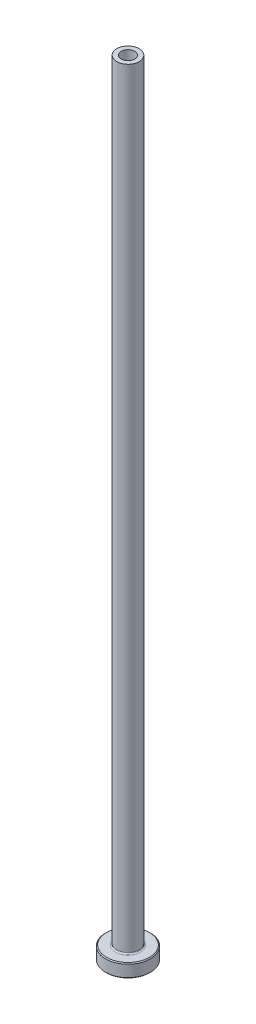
ISO-10303-21;
HEADER;
FILE_DESCRIPTION(('STEP AP214'),'2;1');
FILE_NAME('part.step','',(''),(''),'','','');
FILE_SCHEMA(('AUTOMOTIVE_DESIGN { 1 0 10303 214 1 1 1 1 }'));
ENDSEC;
DATA;
#1=APPLICATION_CONTEXT('core data for automotive mechanical design processes');
#2=APPLICATION_PROTOCOL_DEFINITION('international standard','automotive_design',2000,#1);
#3=PRODUCT_CONTEXT('',#1,'mechanical');
#4=PRODUCT('Part','Part','',(#3));
#5=PRODUCT_RELATED_PRODUCT_CATEGORY('part','',(#4));
#6=PRODUCT_DEFINITION_FORMATION('','',#4);
#7=PRODUCT_DEFINITION_CONTEXT('part definition',#1,'design');
#8=PRODUCT_DEFINITION('design','',#6,#7);
#9=PRODUCT_DEFINITION_SHAPE('','',#8);
#10=(LENGTH_UNIT() NAMED_UNIT(*) SI_UNIT(.MILLI.,.METRE.));
#11=(NAMED_UNIT(*) PLANE_ANGLE_UNIT() SI_UNIT($,.RADIAN.));
#12=(NAMED_UNIT(*) SI_UNIT($,.STERADIAN.) SOLID_ANGLE_UNIT());
#13=UNCERTAINTY_MEASURE_WITH_UNIT(LENGTH_MEASURE(1.E-05),#10,'distance_accuracy_value','');
#14=(GEOMETRIC_REPRESENTATION_CONTEXT(3) GLOBAL_UNCERTAINTY_ASSIGNED_CONTEXT((#13)) GLOBAL_UNIT_ASSIGNED_CONTEXT((#10,
#11,#12)) REPRESENTATION_CONTEXT('',''));
#15=CARTESIAN_POINT('',(0.,0.,0.));
#16=DIRECTION('',(0.,0.,1.));
#17=DIRECTION('',(1.,0.,0.));
#18=AXIS2_PLACEMENT_3D('',#15,#16,#17);
#19=CARTESIAN_POINT('',(0.,92.1876809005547,0.));
#20=DIRECTION('',(0.,1.,0.));
#21=DIRECTION('',(0.,0.,1.));
#22=AXIS2_PLACEMENT_3D('',#19,#20,#21);
#23=CYLINDRICAL_SURFACE('',#22,1.5);
#24=CARTESIAN_POINT('',(0.,175.,0.));
#25=DIRECTION('',(0.,1.,0.));
#26=DIRECTION('',(0.,0.,1.));
#27=AXIS2_PLACEMENT_3D('',#24,#25,#26);
#28=CIRCLE('',#27,1.5);
#29=CARTESIAN_POINT('',(0.,175.,1.5));
#30=VERTEX_POINT('',#29);
#31=EDGE_CURVE('E62',#30,#30,#28,.T.);
#32=ORIENTED_EDGE('',*,*,#31,.T.);
#33=EDGE_LOOP('',(#32));
#34=FACE_BOUND('',#33,.T.);
#35=CARTESIAN_POINT('',(0.,130.,0.));
#36=DIRECTION('',(0.,1.,0.));
#37=DIRECTION('',(0.,0.,1.));
#38=AXIS2_PLACEMENT_3D('',#35,#36,#37);
#39=CIRCLE('',#38,1.5);
#40=CARTESIAN_POINT('',(0.,130.,1.5));
#41=VERTEX_POINT('',#40);
#42=EDGE_CURVE('E71',#41,#41,#39,.T.);
#43=ORIENTED_EDGE('',*,*,#42,.F.);
#44=EDGE_LOOP('',(#43));
#45=FACE_BOUND('',#44,.T.);
#46=ADVANCED_FACE('F30',(#34,#45),#23,.F.);
#47=CARTESIAN_POINT('',(-1.5,175.,0.));
#48=DIRECTION('',(0.,1.,0.));
#49=DIRECTION('',(0.,0.,1.));
#50=AXIS2_PLACEMENT_3D('',#47,#48,#49);
#51=PLANE('',#50);
#52=CARTESIAN_POINT('',(0.,175.,0.));
#53=DIRECTION('',(0.,1.,0.));
#54=DIRECTION('',(0.,0.,1.));
#55=AXIS2_PLACEMENT_3D('',#52,#53,#54);
#56=CIRCLE('',#55,2.50000000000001);
#57=CARTESIAN_POINT('',(0.,175.,2.50000000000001));
#58=VERTEX_POINT('',#57);
#59=EDGE_CURVE('E65',#58,#58,#56,.T.);
#60=ORIENTED_EDGE('',*,*,#59,.T.);
#61=EDGE_LOOP('',(#60));
#62=FACE_BOUND('',#61,.T.);
#63=ORIENTED_EDGE('',*,*,#31,.F.);
#64=EDGE_LOOP('',(#63));
#65=FACE_BOUND('',#64,.T.);
#66=ADVANCED_FACE('F79',(#62,#65),#51,.T.);
#67=CARTESIAN_POINT('',(0.,92.1876809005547,0.));
#68=DIRECTION('',(0.,1.,0.));
#69=DIRECTION('',(0.,0.,1.));
#70=AXIS2_PLACEMENT_3D('',#67,#68,#69);
#71=CYLINDRICAL_SURFACE('',#70,2.5);
#72=CARTESIAN_POINT('',(0.,3.3,0.));
#73=DIRECTION('',(0.,1.,0.));
#74=DIRECTION('',(0.,0.,1.));
#75=AXIS2_PLACEMENT_3D('',#72,#73,#74);
#76=CIRCLE('',#75,2.5);
#77=CARTESIAN_POINT('',(0.,3.3,2.5));
#78=VERTEX_POINT('',#77);
#79=EDGE_CURVE('E59',#78,#78,#76,.T.);
#80=ORIENTED_EDGE('',*,*,#79,.T.);
#81=EDGE_LOOP('',(#80));
#82=FACE_BOUND('',#81,.T.);
#83=ORIENTED_EDGE('',*,*,#59,.F.);
#84=EDGE_LOOP('',(#83));
#85=FACE_BOUND('',#84,.T.);
#86=ADVANCED_FACE('F85',(#82,#85),#71,.T.);
#87=CARTESIAN_POINT('',(-2.49999999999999,3.,0.));
#88=DIRECTION('',(0.,1.,0.));
#89=DIRECTION('',(0.,0.,1.));
#90=AXIS2_PLACEMENT_3D('',#87,#88,#89);
#91=PLANE('',#90);
#92=CARTESIAN_POINT('',(0.,3.,0.));
#93=DIRECTION('',(0.,1.,0.));
#94=DIRECTION('',(0.,0.,1.));
#95=AXIS2_PLACEMENT_3D('',#92,#93,#94);
#96=CIRCLE('',#95,4.8);
#97=CARTESIAN_POINT('',(0.,3.,4.8));
#98=VERTEX_POINT('',#97);
#99=EDGE_CURVE('E53',#98,#98,#96,.T.);
#100=ORIENTED_EDGE('',*,*,#99,.T.);
#101=EDGE_LOOP('',(#100));
#102=FACE_BOUND('',#101,.T.);
#103=CARTESIAN_POINT('',(0.,3.,0.));
#104=DIRECTION('',(0.,1.,0.));
#105=DIRECTION('',(0.,0.,1.));
#106=AXIS2_PLACEMENT_3D('',#103,#104,#105);
#107=CIRCLE('',#106,2.8);
#108=CARTESIAN_POINT('',(0.,3.,2.8));
#109=VERTEX_POINT('',#108);
#110=EDGE_CURVE('E56',#109,#109,#107,.F.);
#111=ORIENTED_EDGE('',*,*,#110,.T.);
#112=EDGE_LOOP('',(#111));
#113=FACE_BOUND('',#112,.T.);
#114=ADVANCED_FACE('F111',(#102,#113),#91,.T.);
#115=CARTESIAN_POINT('',(0.,92.1876809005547,0.));
#116=DIRECTION('',(0.,1.,0.));
#117=DIRECTION('',(0.,0.,1.));
#118=AXIS2_PLACEMENT_3D('',#115,#116,#117);
#119=CYLINDRICAL_SURFACE('',#118,4.99999999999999);
#120=CARTESIAN_POINT('',(0.,2.8,0.));
#121=DIRECTION('',(0.,1.,0.));
#122=DIRECTION('',(0.,0.,1.));
#123=AXIS2_PLACEMENT_3D('',#120,#121,#122);
#124=CIRCLE('',#123,4.99999999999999);
#125=CARTESIAN_POINT('',(0.,2.8,4.99999999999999));
#126=VERTEX_POINT('',#125);
#127=EDGE_CURVE('E45',#126,#126,#124,.F.);
#128=ORIENTED_EDGE('',*,*,#127,.T.);
#129=EDGE_LOOP('',(#128));
#130=FACE_BOUND('',#129,.T.);
#131=CARTESIAN_POINT('',(0.,0.200000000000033,0.));
#132=DIRECTION('',(0.,-1.,0.));
#133=DIRECTION('',(0.,0.,-1.));
#134=AXIS2_PLACEMENT_3D('',#131,#132,#133);
#135=CIRCLE('',#134,4.99999999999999);
#136=CARTESIAN_POINT('',(0.,0.200000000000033,-4.99999999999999));
#137=VERTEX_POINT('',#136);
#138=EDGE_CURVE('E50',#137,#137,#135,.F.);
#139=ORIENTED_EDGE('',*,*,#138,.T.);
#140=EDGE_LOOP('',(#139));
#141=FACE_BOUND('',#140,.T.);
#142=ADVANCED_FACE('F108',(#130,#141),#119,.T.);
#143=CARTESIAN_POINT('',(-4.99999999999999,0.,0.));
#144=DIRECTION('',(0.,-1.,0.));
#145=DIRECTION('',(0.,0.,-1.));
#146=AXIS2_PLACEMENT_3D('',#143,#144,#145);
#147=PLANE('',#146);
#148=CARTESIAN_POINT('',(0.,0.,0.));
#149=DIRECTION('',(0.,-1.,0.));
#150=DIRECTION('',(0.,0.,-1.));
#151=AXIS2_PLACEMENT_3D('',#148,#149,#150);
#152=CIRCLE('',#151,2.24999999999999);
#153=CARTESIAN_POINT('',(0.,0.,-2.24999999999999));
#154=VERTEX_POINT('',#153);
#155=EDGE_CURVE('E37',#154,#154,#152,.F.);
#156=ORIENTED_EDGE('',*,*,#155,.T.);
#157=EDGE_LOOP('',(#156));
#158=FACE_BOUND('',#157,.T.);
#159=CARTESIAN_POINT('',(0.,0.,0.));
#160=DIRECTION('',(0.,-1.,0.));
#161=DIRECTION('',(0.,0.,-1.));
#162=AXIS2_PLACEMENT_3D('',#159,#160,#161);
#163=CIRCLE('',#162,4.79999999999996);
#164=CARTESIAN_POINT('',(0.,0.,-4.79999999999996));
#165=VERTEX_POINT('',#164);
#166=EDGE_CURVE('E41',#165,#165,#163,.T.);
#167=ORIENTED_EDGE('',*,*,#166,.T.);
#168=EDGE_LOOP('',(#167));
#169=FACE_BOUND('',#168,.T.);
#170=ADVANCED_FACE('F110',(#158,#169),#147,.T.);
#171=CARTESIAN_POINT('',(0.,92.1876809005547,0.));
#172=DIRECTION('',(0.,1.,0.));
#173=DIRECTION('',(0.,0.,1.));
#174=AXIS2_PLACEMENT_3D('',#171,#172,#173);
#175=CYLINDRICAL_SURFACE('',#174,1.75);
#176=CARTESIAN_POINT('',(0.,0.499999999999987,0.));
#177=DIRECTION('',(0.,-1.,0.));
#178=DIRECTION('',(0.,0.,-1.));
#179=AXIS2_PLACEMENT_3D('',#176,#177,#178);
#180=CIRCLE('',#179,1.75);
#181=CARTESIAN_POINT('',(0.,0.499999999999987,-1.75));
#182=VERTEX_POINT('',#181);
#183=EDGE_CURVE('E10',#182,#182,#180,.T.);
#184=ORIENTED_EDGE('',*,*,#183,.T.);
#185=EDGE_LOOP('',(#184));
#186=FACE_BOUND('',#185,.T.);
#187=CARTESIAN_POINT('',(0.,118.,0.));
#188=DIRECTION('',(0.,1.,0.));
#189=DIRECTION('',(0.,0.,1.));
#190=AXIS2_PLACEMENT_3D('',#187,#188,#189);
#191=CIRCLE('',#190,1.75);
#192=CARTESIAN_POINT('',(0.,118.,1.75));
#193=VERTEX_POINT('',#192);
#194=EDGE_CURVE('E68',#193,#193,#191,.T.);
#195=ORIENTED_EDGE('',*,*,#194,.T.);
#196=EDGE_LOOP('',(#195));
#197=FACE_BOUND('',#196,.T.);
#198=ADVANCED_FACE('F118',(#186,#197),#175,.F.);
#199=CARTESIAN_POINT('',(0.,118.,0.));
#200=DIRECTION('',(0.,-1.,0.));
#201=DIRECTION('',(0.,0.,-1.));
#202=AXIS2_PLACEMENT_3D('',#199,#200,#201);
#203=CONICAL_SURFACE('',#202,1.75,0.0208303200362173);
#204=ORIENTED_EDGE('',*,*,#42,.T.);
#205=EDGE_LOOP('',(#204));
#206=FACE_BOUND('',#205,.T.);
#207=ORIENTED_EDGE('',*,*,#194,.F.);
#208=EDGE_LOOP('',(#207));
#209=FACE_BOUND('',#208,.T.);
#210=ADVANCED_FACE('F75',(#206,#209),#203,.F.);
#211=CARTESIAN_POINT('',(0.,3.3,0.));
#212=DIRECTION('',(0.,1.,0.));
#213=DIRECTION('',(0.,0.,1.));
#214=AXIS2_PLACEMENT_3D('',#211,#212,#213);
#215=TOROIDAL_SURFACE('',#214,2.8,0.3);
#216=ORIENTED_EDGE('',*,*,#110,.F.);
#217=EDGE_LOOP('',(#216));
#218=FACE_BOUND('',#217,.T.);
#219=ORIENTED_EDGE('',*,*,#79,.F.);
#220=EDGE_LOOP('',(#219));
#221=FACE_BOUND('',#220,.T.);
#222=ADVANCED_FACE('F90',(#218,#221),#215,.F.);
#223=CARTESIAN_POINT('',(0.,3.,0.));
#224=DIRECTION('',(0.,-1.,0.));
#225=DIRECTION('',(0.,0.,-1.));
#226=AXIS2_PLACEMENT_3D('',#223,#224,#225);
#227=CONICAL_SURFACE('',#226,4.8,0.785398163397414);
#228=ORIENTED_EDGE('',*,*,#127,.F.);
#229=EDGE_LOOP('',(#228));
#230=FACE_BOUND('',#229,.T.);
#231=ORIENTED_EDGE('',*,*,#99,.F.);
#232=EDGE_LOOP('',(#231));
#233=FACE_BOUND('',#232,.T.);
#234=ADVANCED_FACE('F93',(#230,#233),#227,.T.);
#235=CARTESIAN_POINT('',(0.,0.200000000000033,0.));
#236=DIRECTION('',(0.,1.,0.));
#237=DIRECTION('',(0.,0.,1.));
#238=AXIS2_PLACEMENT_3D('',#235,#236,#237);
#239=CONICAL_SURFACE('',#238,4.99999999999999,0.785398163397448);
#240=ORIENTED_EDGE('',*,*,#166,.F.);
#241=EDGE_LOOP('',(#240));
#242=FACE_BOUND('',#241,.T.);
#243=ORIENTED_EDGE('',*,*,#138,.F.);
#244=EDGE_LOOP('',(#243));
#245=FACE_BOUND('',#244,.T.);
#246=ADVANCED_FACE('F96',(#242,#245),#239,.T.);
#247=CARTESIAN_POINT('',(0.,0.,0.));
#248=DIRECTION('',(0.,-1.,0.));
#249=DIRECTION('',(0.,0.,-1.));
#250=AXIS2_PLACEMENT_3D('',#247,#248,#249);
#251=CONICAL_SURFACE('',#250,2.24999999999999,0.785398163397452);
#252=ORIENTED_EDGE('',*,*,#183,.F.);
#253=EDGE_LOOP('',(#252));
#254=FACE_BOUND('',#253,.T.);
#255=ORIENTED_EDGE('',*,*,#155,.F.);
#256=EDGE_LOOP('',(#255));
#257=FACE_BOUND('',#256,.T.);
#258=ADVANCED_FACE('F32',(#254,#257),#251,.F.);
#259=CLOSED_SHELL('',(#46,#66,#86,#114,#142,#170,#198,#210,#222,#234,#246,#258));
#260=MANIFOLD_SOLID_BREP('B2',#259);
#261=ADVANCED_BREP_SHAPE_REPRESENTATION('',(#18,#260),#14);
#262=SHAPE_DEFINITION_REPRESENTATION(#9,#261);
ENDSEC;
END-ISO-10303-21;
